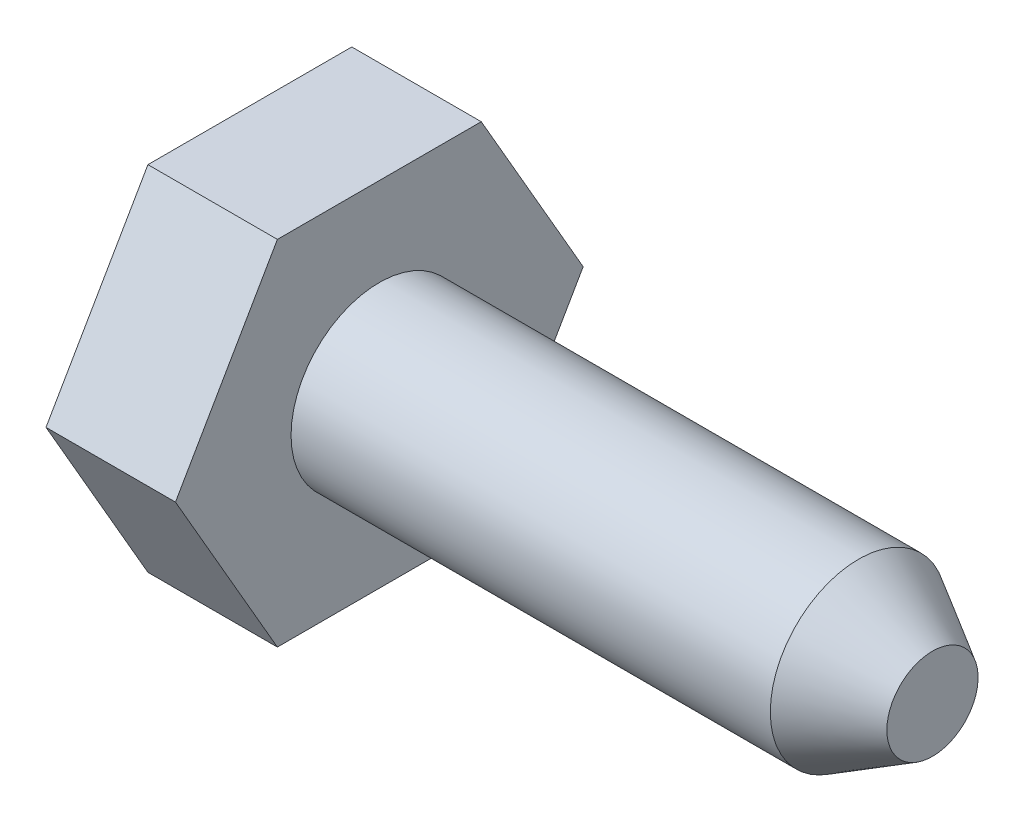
ISO-10303-21;
HEADER;
FILE_DESCRIPTION(('STEP AP214'),'2;1');
FILE_NAME('part.step','',(''),(''),'','','');
FILE_SCHEMA(('AUTOMOTIVE_DESIGN { 1 0 10303 214 1 1 1 1 }'));
ENDSEC;
DATA;
#1=APPLICATION_CONTEXT('core data for automotive mechanical design processes');
#2=APPLICATION_PROTOCOL_DEFINITION('international standard','automotive_design',2000,#1);
#3=PRODUCT_CONTEXT('',#1,'mechanical');
#4=PRODUCT('Part','Part','',(#3));
#5=PRODUCT_RELATED_PRODUCT_CATEGORY('part','',(#4));
#6=PRODUCT_DEFINITION_FORMATION('','',#4);
#7=PRODUCT_DEFINITION_CONTEXT('part definition',#1,'design');
#8=PRODUCT_DEFINITION('design','',#6,#7);
#9=PRODUCT_DEFINITION_SHAPE('','',#8);
#10=(LENGTH_UNIT() NAMED_UNIT(*) SI_UNIT(.MILLI.,.METRE.));
#11=(NAMED_UNIT(*) PLANE_ANGLE_UNIT() SI_UNIT($,.RADIAN.));
#12=(NAMED_UNIT(*) SI_UNIT($,.STERADIAN.) SOLID_ANGLE_UNIT());
#13=UNCERTAINTY_MEASURE_WITH_UNIT(LENGTH_MEASURE(1.E-05),#10,'distance_accuracy_value','');
#14=(GEOMETRIC_REPRESENTATION_CONTEXT(3) GLOBAL_UNCERTAINTY_ASSIGNED_CONTEXT((#13)) GLOBAL_UNIT_ASSIGNED_CONTEXT((#10,
#11,#12)) REPRESENTATION_CONTEXT('',''));
#15=CARTESIAN_POINT('',(0.,0.,0.));
#16=DIRECTION('',(0.,0.,1.));
#17=DIRECTION('',(1.,0.,0.));
#18=AXIS2_PLACEMENT_3D('',#15,#16,#17);
#19=CARTESIAN_POINT('',(0.,0.,0.));
#20=DIRECTION('',(-1.,0.,0.));
#21=DIRECTION('',(0.,0.,1.));
#22=AXIS2_PLACEMENT_3D('',#19,#20,#21);
#23=CYLINDRICAL_SURFACE('',#22,0.762);
#24=CARTESIAN_POINT('',(0.,0.,0.));
#25=DIRECTION('',(-1.,0.,0.));
#26=DIRECTION('',(0.,0.,1.));
#27=AXIS2_PLACEMENT_3D('',#24,#25,#26);
#28=CIRCLE('',#27,0.762);
#29=CARTESIAN_POINT('',(0.,0.,0.762));
#30=VERTEX_POINT('',#29);
#31=EDGE_CURVE('E188',#30,#30,#28,.T.);
#32=ORIENTED_EDGE('',*,*,#31,.F.);
#33=EDGE_LOOP('',(#32));
#34=FACE_BOUND('',#33,.T.);
#35=CARTESIAN_POINT('',(4.13728568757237,0.,0.));
#36=DIRECTION('',(-1.,0.,0.));
#37=DIRECTION('',(0.,0.,1.));
#38=AXIS2_PLACEMENT_3D('',#35,#36,#37);
#39=CIRCLE('',#38,0.762);
#40=CARTESIAN_POINT('',(4.13728568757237,0.,0.762));
#41=VERTEX_POINT('',#40);
#42=EDGE_CURVE('E156',#41,#41,#39,.T.);
#43=ORIENTED_EDGE('',*,*,#42,.T.);
#44=EDGE_LOOP('',(#43));
#45=FACE_BOUND('',#44,.T.);
#46=ADVANCED_FACE('F78',(#34,#45),#23,.T.);
#47=CARTESIAN_POINT('',(-0.89408,1.2192,0.));
#48=DIRECTION('',(1.,0.,0.));
#49=DIRECTION('',(0.,0.,-1.));
#50=AXIS2_PLACEMENT_3D('',#47,#48,#49);
#51=PLANE('',#50);
#52=CARTESIAN_POINT('',(-0.89408,0.,0.));
#53=DIRECTION('',(-1.,0.,0.));
#54=DIRECTION('',(0.,0.,1.));
#55=AXIS2_PLACEMENT_3D('',#52,#53,#54);
#56=CIRCLE('',#55,1.2192);
#57=CARTESIAN_POINT('',(-0.89408,0.,1.2192));
#58=VERTEX_POINT('',#57);
#59=EDGE_CURVE('E51',#58,#58,#56,.T.);
#60=ORIENTED_EDGE('',*,*,#59,.T.);
#61=EDGE_LOOP('',(#60));
#62=FACE_BOUND('',#61,.T.);
#63=ADVANCED_FACE('F80',(#62),#51,.F.);
#64=CARTESIAN_POINT('',(0.,0.,0.));
#65=DIRECTION('',(-1.,0.,0.));
#66=DIRECTION('',(0.,0.,1.));
#67=AXIS2_PLACEMENT_3D('',#64,#65,#66);
#68=CYLINDRICAL_SURFACE('',#67,1.2192);
#69=ORIENTED_EDGE('',*,*,#59,.F.);
#70=EDGE_LOOP('',(#69));
#71=FACE_BOUND('',#70,.T.);
#72=CARTESIAN_POINT('',(-1.1176,0.,0.));
#73=DIRECTION('',(-1.,0.,0.));
#74=DIRECTION('',(0.,0.,1.));
#75=AXIS2_PLACEMENT_3D('',#72,#73,#74);
#76=CIRCLE('',#75,1.2192);
#77=CARTESIAN_POINT('',(-1.1176,0.,1.2192));
#78=VERTEX_POINT('',#77);
#79=EDGE_CURVE('E86',#78,#78,#76,.T.);
#80=ORIENTED_EDGE('',*,*,#79,.T.);
#81=EDGE_LOOP('',(#80));
#82=FACE_BOUND('',#81,.T.);
#83=ADVANCED_FACE('F193',(#71,#82),#68,.F.);
#84=CARTESIAN_POINT('',(-1.1176,1.524,0.));
#85=DIRECTION('',(1.,0.,0.));
#86=DIRECTION('',(0.,0.,-1.));
#87=AXIS2_PLACEMENT_3D('',#84,#85,#86);
#88=PLANE('',#87);
#89=ORIENTED_EDGE('',*,*,#79,.F.);
#90=EDGE_LOOP('',(#89));
#91=FACE_BOUND('',#90,.T.);
#92=DIRECTION('',(0.,-0.866025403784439,0.5));
#93=VECTOR('',#92,1.);
#94=CARTESIAN_POINT('',(-1.1176,-0.762000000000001,-1.31982271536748));
#95=LINE('',#94,#93);
#96=CARTESIAN_POINT('',(-1.1176,0.,-1.75976362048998));
#97=VERTEX_POINT('',#96);
#98=CARTESIAN_POINT('',(-1.1176,-1.524,-0.87988181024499));
#99=VERTEX_POINT('',#98);
#100=EDGE_CURVE('E131',#97,#99,#95,.T.);
#101=ORIENTED_EDGE('',*,*,#100,.T.);
#102=DIRECTION('',(0.,0.,1.));
#103=VECTOR('',#102,1.);
#104=CARTESIAN_POINT('',(-1.1176,-1.524,0.));
#105=LINE('',#104,#103);
#106=CARTESIAN_POINT('',(-1.1176,-1.524,0.879881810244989));
#107=VERTEX_POINT('',#106);
#108=EDGE_CURVE('E135',#99,#107,#105,.T.);
#109=ORIENTED_EDGE('',*,*,#108,.T.);
#110=DIRECTION('',(0.,0.866025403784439,0.5));
#111=VECTOR('',#110,1.);
#112=CARTESIAN_POINT('',(-1.1176,-0.762,1.31982271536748));
#113=LINE('',#112,#111);
#114=CARTESIAN_POINT('',(-1.1176,0.,1.75976362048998));
#115=VERTEX_POINT('',#114);
#116=EDGE_CURVE('E165',#107,#115,#113,.T.);
#117=ORIENTED_EDGE('',*,*,#116,.T.);
#118=DIRECTION('',(0.,0.866025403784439,-0.5));
#119=VECTOR('',#118,1.);
#120=CARTESIAN_POINT('',(-1.1176,0.762,1.31982271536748));
#121=LINE('',#120,#119);
#122=CARTESIAN_POINT('',(-1.1176,1.524,0.879881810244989));
#123=VERTEX_POINT('',#122);
#124=EDGE_CURVE('E171',#115,#123,#121,.T.);
#125=ORIENTED_EDGE('',*,*,#124,.T.);
#126=DIRECTION('',(0.,0.,-1.));
#127=VECTOR('',#126,1.);
#128=CARTESIAN_POINT('',(-1.1176,1.524,0.));
#129=LINE('',#128,#127);
#130=CARTESIAN_POINT('',(-1.1176,1.524,-0.87988181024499));
#131=VERTEX_POINT('',#130);
#132=EDGE_CURVE('E179',#123,#131,#129,.T.);
#133=ORIENTED_EDGE('',*,*,#132,.T.);
#134=DIRECTION('',(0.,-0.866025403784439,-0.5));
#135=VECTOR('',#134,1.);
#136=CARTESIAN_POINT('',(-1.1176,0.762,-1.31982271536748));
#137=LINE('',#136,#135);
#138=EDGE_CURVE('E137',#131,#97,#137,.T.);
#139=ORIENTED_EDGE('',*,*,#138,.T.);
#140=EDGE_LOOP('',(#101,#109,#117,#125,#133,#139));
#141=FACE_BOUND('',#140,.T.);
#142=ADVANCED_FACE('F133',(#91,#141),#88,.F.);
#143=CARTESIAN_POINT('',(0.,0.762,0.));
#144=DIRECTION('',(-1.,0.,0.));
#145=DIRECTION('',(0.,0.,1.));
#146=AXIS2_PLACEMENT_3D('',#143,#144,#145);
#147=PLANE('',#146);
#148=DIRECTION('',(0.,0.,-1.));
#149=VECTOR('',#148,1.);
#150=CARTESIAN_POINT('',(0.,-1.524,0.));
#151=LINE('',#150,#149);
#152=CARTESIAN_POINT('',(0.,-1.524,0.879881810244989));
#153=VERTEX_POINT('',#152);
#154=CARTESIAN_POINT('',(0.,-1.524,-0.87988181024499));
#155=VERTEX_POINT('',#154);
#156=EDGE_CURVE('E149',#153,#155,#151,.T.);
#157=ORIENTED_EDGE('',*,*,#156,.T.);
#158=DIRECTION('',(0.,0.866025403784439,-0.5));
#159=VECTOR('',#158,1.);
#160=CARTESIAN_POINT('',(0.,-0.762000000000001,-1.31982271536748));
#161=LINE('',#160,#159);
#162=CARTESIAN_POINT('',(0.,0.,-1.75976362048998));
#163=VERTEX_POINT('',#162);
#164=EDGE_CURVE('E93',#155,#163,#161,.T.);
#165=ORIENTED_EDGE('',*,*,#164,.T.);
#166=DIRECTION('',(0.,0.866025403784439,0.5));
#167=VECTOR('',#166,1.);
#168=CARTESIAN_POINT('',(0.,0.762,-1.31982271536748));
#169=LINE('',#168,#167);
#170=CARTESIAN_POINT('',(0.,1.524,-0.87988181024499));
#171=VERTEX_POINT('',#170);
#172=EDGE_CURVE('E183',#163,#171,#169,.T.);
#173=ORIENTED_EDGE('',*,*,#172,.T.);
#174=DIRECTION('',(0.,0.,1.));
#175=VECTOR('',#174,1.);
#176=CARTESIAN_POINT('',(0.,1.524,0.));
#177=LINE('',#176,#175);
#178=CARTESIAN_POINT('',(0.,1.524,0.879881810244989));
#179=VERTEX_POINT('',#178);
#180=EDGE_CURVE('E181',#171,#179,#177,.T.);
#181=ORIENTED_EDGE('',*,*,#180,.T.);
#182=DIRECTION('',(0.,-0.866025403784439,0.5));
#183=VECTOR('',#182,1.);
#184=CARTESIAN_POINT('',(0.,0.762,1.31982271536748));
#185=LINE('',#184,#183);
#186=CARTESIAN_POINT('',(0.,0.,1.75976362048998));
#187=VERTEX_POINT('',#186);
#188=EDGE_CURVE('E174',#179,#187,#185,.T.);
#189=ORIENTED_EDGE('',*,*,#188,.T.);
#190=DIRECTION('',(0.,-0.866025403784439,-0.5));
#191=VECTOR('',#190,1.);
#192=CARTESIAN_POINT('',(0.,-0.762,1.31982271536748));
#193=LINE('',#192,#191);
#194=EDGE_CURVE('E162',#187,#153,#193,.T.);
#195=ORIENTED_EDGE('',*,*,#194,.T.);
#196=EDGE_LOOP('',(#157,#165,#173,#181,#189,#195));
#197=FACE_BOUND('',#196,.T.);
#198=ORIENTED_EDGE('',*,*,#31,.T.);
#199=EDGE_LOOP('',(#198));
#200=FACE_BOUND('',#199,.T.);
#201=ADVANCED_FACE('F196',(#197,#200),#147,.F.);
#202=CARTESIAN_POINT('',(1.58622949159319,0.762,-1.31982271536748));
#203=DIRECTION('',(0.,0.5,-0.866025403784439));
#204=DIRECTION('',(0.,0.866025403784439,0.5));
#205=AXIS2_PLACEMENT_3D('',#202,#203,#204);
#206=PLANE('',#205);
#207=ORIENTED_EDGE('',*,*,#172,.F.);
#208=DIRECTION('',(-1.,0.,0.));
#209=VECTOR('',#208,1.);
#210=CARTESIAN_POINT('',(1.58622949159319,0.,-1.75976362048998));
#211=LINE('',#210,#209);
#212=EDGE_CURVE('E100',#163,#97,#211,.T.);
#213=ORIENTED_EDGE('',*,*,#212,.T.);
#214=ORIENTED_EDGE('',*,*,#138,.F.);
#215=DIRECTION('',(-1.,0.,0.));
#216=VECTOR('',#215,1.);
#217=CARTESIAN_POINT('',(1.58622949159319,1.524,-0.87988181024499));
#218=LINE('',#217,#216);
#219=EDGE_CURVE('E176',#171,#131,#218,.T.);
#220=ORIENTED_EDGE('',*,*,#219,.F.);
#221=EDGE_LOOP('',(#207,#213,#214,#220));
#222=FACE_BOUND('',#221,.T.);
#223=ADVANCED_FACE('F202',(#222),#206,.T.);
#224=CARTESIAN_POINT('',(1.58622949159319,-0.762000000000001,-1.31982271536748));
#225=DIRECTION('',(0.,-0.5,-0.866025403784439));
#226=DIRECTION('',(0.,0.866025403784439,-0.5));
#227=AXIS2_PLACEMENT_3D('',#224,#225,#226);
#228=PLANE('',#227);
#229=ORIENTED_EDGE('',*,*,#164,.F.);
#230=DIRECTION('',(-1.,0.,0.));
#231=VECTOR('',#230,1.);
#232=CARTESIAN_POINT('',(1.58622949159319,-1.524,-0.87988181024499));
#233=LINE('',#232,#231);
#234=EDGE_CURVE('E146',#155,#99,#233,.T.);
#235=ORIENTED_EDGE('',*,*,#234,.T.);
#236=ORIENTED_EDGE('',*,*,#100,.F.);
#237=ORIENTED_EDGE('',*,*,#212,.F.);
#238=EDGE_LOOP('',(#229,#235,#236,#237));
#239=FACE_BOUND('',#238,.T.);
#240=ADVANCED_FACE('F151',(#239),#228,.T.);
#241=CARTESIAN_POINT('',(1.58622949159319,1.524,0.));
#242=DIRECTION('',(0.,1.,0.));
#243=DIRECTION('',(0.,0.,1.));
#244=AXIS2_PLACEMENT_3D('',#241,#242,#243);
#245=PLANE('',#244);
#246=ORIENTED_EDGE('',*,*,#180,.F.);
#247=ORIENTED_EDGE('',*,*,#219,.T.);
#248=ORIENTED_EDGE('',*,*,#132,.F.);
#249=DIRECTION('',(-1.,0.,0.));
#250=VECTOR('',#249,1.);
#251=CARTESIAN_POINT('',(1.58622949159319,1.524,0.879881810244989));
#252=LINE('',#251,#250);
#253=EDGE_CURVE('E164',#179,#123,#252,.T.);
#254=ORIENTED_EDGE('',*,*,#253,.F.);
#255=EDGE_LOOP('',(#246,#247,#248,#254));
#256=FACE_BOUND('',#255,.T.);
#257=ADVANCED_FACE('F226',(#256),#245,.T.);
#258=CARTESIAN_POINT('',(1.58622949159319,0.762,1.31982271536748));
#259=DIRECTION('',(0.,0.5,0.866025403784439));
#260=DIRECTION('',(0.,-0.866025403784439,0.5));
#261=AXIS2_PLACEMENT_3D('',#258,#259,#260);
#262=PLANE('',#261);
#263=ORIENTED_EDGE('',*,*,#188,.F.);
#264=ORIENTED_EDGE('',*,*,#253,.T.);
#265=ORIENTED_EDGE('',*,*,#124,.F.);
#266=DIRECTION('',(-1.,0.,0.));
#267=VECTOR('',#266,1.);
#268=CARTESIAN_POINT('',(1.58622949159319,0.,1.75976362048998));
#269=LINE('',#268,#267);
#270=EDGE_CURVE('E161',#187,#115,#269,.T.);
#271=ORIENTED_EDGE('',*,*,#270,.F.);
#272=EDGE_LOOP('',(#263,#264,#265,#271));
#273=FACE_BOUND('',#272,.T.);
#274=ADVANCED_FACE('F229',(#273),#262,.T.);
#275=CARTESIAN_POINT('',(1.58622949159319,-0.762,1.31982271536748));
#276=DIRECTION('',(0.,-0.5,0.866025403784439));
#277=DIRECTION('',(0.,-0.866025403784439,-0.5));
#278=AXIS2_PLACEMENT_3D('',#275,#276,#277);
#279=PLANE('',#278);
#280=ORIENTED_EDGE('',*,*,#194,.F.);
#281=ORIENTED_EDGE('',*,*,#270,.T.);
#282=ORIENTED_EDGE('',*,*,#116,.F.);
#283=DIRECTION('',(-1.,0.,0.));
#284=VECTOR('',#283,1.);
#285=CARTESIAN_POINT('',(1.58622949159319,-1.524,0.879881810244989));
#286=LINE('',#285,#284);
#287=EDGE_CURVE('E148',#153,#107,#286,.T.);
#288=ORIENTED_EDGE('',*,*,#287,.F.);
#289=EDGE_LOOP('',(#280,#281,#282,#288));
#290=FACE_BOUND('',#289,.T.);
#291=ADVANCED_FACE('F233',(#290),#279,.T.);
#292=CARTESIAN_POINT('',(1.58622949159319,-1.524,0.));
#293=DIRECTION('',(0.,-1.,0.));
#294=DIRECTION('',(0.,0.,-1.));
#295=AXIS2_PLACEMENT_3D('',#292,#293,#294);
#296=PLANE('',#295);
#297=ORIENTED_EDGE('',*,*,#156,.F.);
#298=ORIENTED_EDGE('',*,*,#287,.T.);
#299=ORIENTED_EDGE('',*,*,#108,.F.);
#300=ORIENTED_EDGE('',*,*,#234,.F.);
#301=EDGE_LOOP('',(#297,#298,#299,#300));
#302=FACE_BOUND('',#301,.T.);
#303=ADVANCED_FACE('F145',(#302),#296,.T.);
#304=CARTESIAN_POINT('',(4.13728568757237,0.,0.));
#305=DIRECTION('',(-1.,0.,0.));
#306=DIRECTION('',(0.,0.,1.));
#307=AXIS2_PLACEMENT_3D('',#304,#305,#306);
#308=CONICAL_SURFACE('',#307,0.762,0.523598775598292);
#309=CARTESIAN_POINT('',(4.7752,0.,0.));
#310=DIRECTION('',(-1.,0.,0.));
#311=DIRECTION('',(0.,0.,1.));
#312=AXIS2_PLACEMENT_3D('',#309,#310,#311);
#313=CIRCLE('',#312,0.3937);
#314=CARTESIAN_POINT('',(4.7752,0.,0.3937));
#315=VERTEX_POINT('',#314);
#316=EDGE_CURVE('E152',#315,#315,#313,.T.);
#317=ORIENTED_EDGE('',*,*,#316,.T.);
#318=EDGE_LOOP('',(#317));
#319=FACE_BOUND('',#318,.T.);
#320=ORIENTED_EDGE('',*,*,#42,.F.);
#321=EDGE_LOOP('',(#320));
#322=FACE_BOUND('',#321,.T.);
#323=ADVANCED_FACE('F220',(#319,#322),#308,.T.);
#324=CARTESIAN_POINT('',(4.7752,0.762,0.));
#325=DIRECTION('',(-1.,0.,0.));
#326=DIRECTION('',(0.,0.,1.));
#327=AXIS2_PLACEMENT_3D('',#324,#325,#326);
#328=PLANE('',#327);
#329=ORIENTED_EDGE('',*,*,#316,.F.);
#330=EDGE_LOOP('',(#329));
#331=FACE_BOUND('',#330,.T.);
#332=ADVANCED_FACE('F217',(#331),#328,.F.);
#333=CLOSED_SHELL('',(#46,#63,#83,#142,#201,#223,#240,#257,#274,#291,#303,#323,#332));
#334=MANIFOLD_SOLID_BREP('B6',#333);
#335=ADVANCED_BREP_SHAPE_REPRESENTATION('',(#18,#334),#14);
#336=SHAPE_DEFINITION_REPRESENTATION(#9,#335);
ENDSEC;
END-ISO-10303-21;
